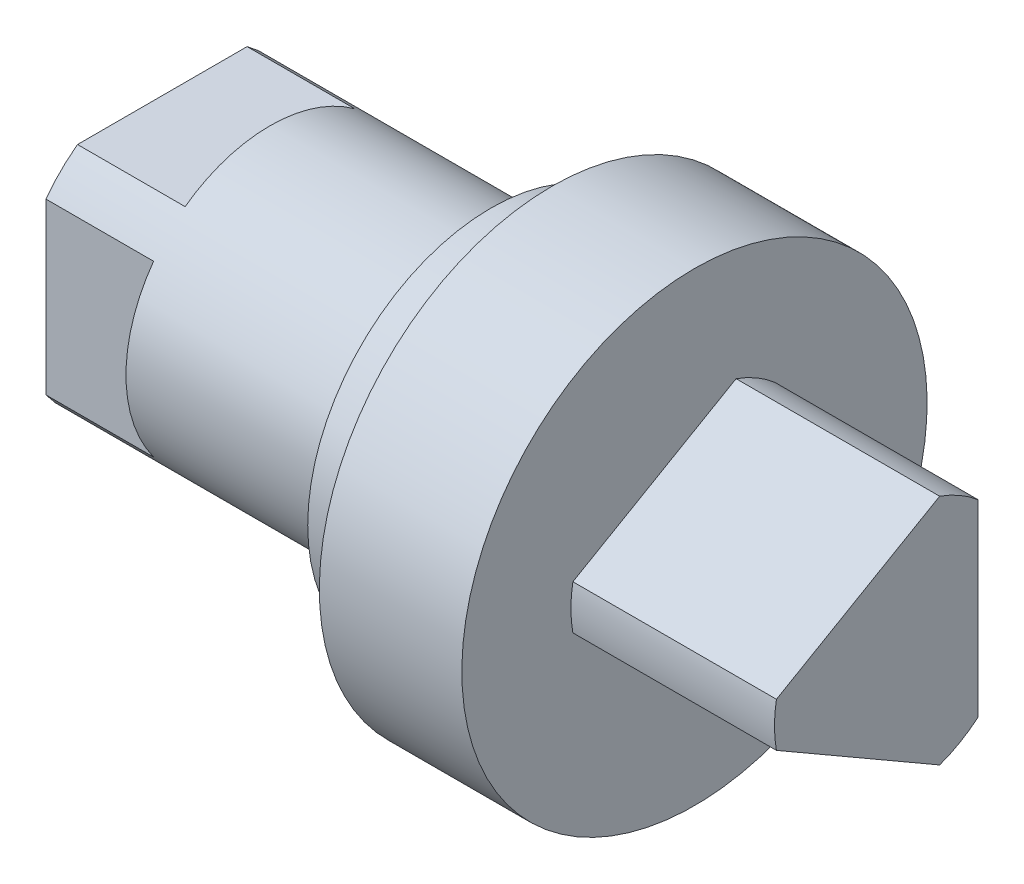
ISO-10303-21;
HEADER;
FILE_DESCRIPTION(('STEP AP214'),'2;1');
FILE_NAME('part.step','',(''),(''),'','','');
FILE_SCHEMA(('AUTOMOTIVE_DESIGN { 1 0 10303 214 1 1 1 1 }'));
ENDSEC;
DATA;
#1=APPLICATION_CONTEXT('core data for automotive mechanical design processes');
#2=APPLICATION_PROTOCOL_DEFINITION('international standard','automotive_design',2000,#1);
#3=PRODUCT_CONTEXT('',#1,'mechanical');
#4=PRODUCT('Part','Part','',(#3));
#5=PRODUCT_RELATED_PRODUCT_CATEGORY('part','',(#4));
#6=PRODUCT_DEFINITION_FORMATION('','',#4);
#7=PRODUCT_DEFINITION_CONTEXT('part definition',#1,'design');
#8=PRODUCT_DEFINITION('design','',#6,#7);
#9=PRODUCT_DEFINITION_SHAPE('','',#8);
#10=(LENGTH_UNIT() NAMED_UNIT(*) SI_UNIT(.MILLI.,.METRE.));
#11=(NAMED_UNIT(*) PLANE_ANGLE_UNIT() SI_UNIT($,.RADIAN.));
#12=(NAMED_UNIT(*) SI_UNIT($,.STERADIAN.) SOLID_ANGLE_UNIT());
#13=UNCERTAINTY_MEASURE_WITH_UNIT(LENGTH_MEASURE(1.E-05),#10,'distance_accuracy_value','');
#14=(GEOMETRIC_REPRESENTATION_CONTEXT(3) GLOBAL_UNCERTAINTY_ASSIGNED_CONTEXT((#13)) GLOBAL_UNIT_ASSIGNED_CONTEXT((#10,
#11,#12)) REPRESENTATION_CONTEXT('',''));
#15=CARTESIAN_POINT('',(0.,0.,0.));
#16=DIRECTION('',(0.,0.,1.));
#17=DIRECTION('',(1.,0.,0.));
#18=AXIS2_PLACEMENT_3D('',#15,#16,#17);
#19=CARTESIAN_POINT('',(-2.29999999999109,0.,0.));
#20=DIRECTION('',(-1.,0.,0.));
#21=DIRECTION('',(0.,0.,1.));
#22=AXIS2_PLACEMENT_3D('',#19,#20,#21);
#23=CONICAL_SURFACE('',#22,2.75000000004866,1.02974425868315);
#24=CARTESIAN_POINT('',(-0.647633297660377,0.,0.));
#25=VERTEX_POINT('',#24);
#26=VERTEX_LOOP('',#25);
#27=FACE_BOUND('',#26,.T.);
#28=CARTESIAN_POINT('',(-2.3,0.,0.));
#29=DIRECTION('',(-1.,0.,0.));
#30=DIRECTION('',(0.,0.,1.));
#31=AXIS2_PLACEMENT_3D('',#28,#29,#30);
#32=CIRCLE('',#31,2.74999999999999);
#33=CARTESIAN_POINT('',(-2.3,0.,2.74999999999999));
#34=VERTEX_POINT('',#33);
#35=EDGE_CURVE('E163',#34,#34,#32,.T.);
#36=ORIENTED_EDGE('',*,*,#35,.T.);
#37=EDGE_LOOP('',(#36));
#38=FACE_BOUND('',#37,.T.);
#39=ADVANCED_FACE('F16',(#27,#38),#23,.F.);
#40=CARTESIAN_POINT('',(-18.3,0.,0.));
#41=DIRECTION('',(-1.,0.,0.));
#42=DIRECTION('',(0.,0.,1.));
#43=AXIS2_PLACEMENT_3D('',#40,#41,#42);
#44=CYLINDRICAL_SURFACE('',#43,2.74999999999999);
#45=ORIENTED_EDGE('',*,*,#35,.F.);
#46=EDGE_LOOP('',(#45));
#47=FACE_BOUND('',#46,.T.);
#48=CARTESIAN_POINT('',(-18.0500000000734,0.,0.));
#49=DIRECTION('',(-1.,0.,0.));
#50=DIRECTION('',(0.,0.,1.));
#51=AXIS2_PLACEMENT_3D('',#48,#49,#50);
#52=CIRCLE('',#51,2.74999999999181);
#53=CARTESIAN_POINT('',(-18.0500000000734,0.,2.74999999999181));
#54=VERTEX_POINT('',#53);
#55=EDGE_CURVE('E109',#54,#54,#52,.T.);
#56=ORIENTED_EDGE('',*,*,#55,.T.);
#57=EDGE_LOOP('',(#56));
#58=FACE_BOUND('',#57,.T.);
#59=ADVANCED_FACE('F369',(#47,#58),#44,.F.);
#60=CARTESIAN_POINT('',(-18.299999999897,0.,0.));
#61=DIRECTION('',(-1.,0.,0.));
#62=DIRECTION('',(0.,0.,1.));
#63=AXIS2_PLACEMENT_3D('',#60,#61,#62);
#64=CONICAL_SURFACE('',#63,2.99999999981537,0.785398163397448);
#65=ORIENTED_EDGE('',*,*,#55,.F.);
#66=EDGE_LOOP('',(#65));
#67=FACE_BOUND('',#66,.T.);
#68=CARTESIAN_POINT('',(-18.3000000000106,0.,0.));
#69=DIRECTION('',(-1.,0.,0.));
#70=DIRECTION('',(0.,0.,1.));
#71=AXIS2_PLACEMENT_3D('',#68,#69,#70);
#72=CIRCLE('',#71,2.99999999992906);
#73=CARTESIAN_POINT('',(-18.3000000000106,0.,2.99999999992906));
#74=VERTEX_POINT('',#73);
#75=EDGE_CURVE('E154',#74,#74,#72,.F.);
#76=ORIENTED_EDGE('',*,*,#75,.F.);
#77=EDGE_LOOP('',(#76));
#78=FACE_BOUND('',#77,.T.);
#79=ADVANCED_FACE('F222',(#67,#78),#64,.F.);
#80=CARTESIAN_POINT('',(-18.3,0.,0.));
#81=DIRECTION('',(-1.,0.,0.));
#82=DIRECTION('',(0.,-1.,0.));
#83=AXIS2_PLACEMENT_3D('',#80,#81,#82);
#84=PLANE('',#83);
#85=ORIENTED_EDGE('',*,*,#75,.T.);
#86=EDGE_LOOP('',(#85));
#87=FACE_BOUND('',#86,.T.);
#88=CARTESIAN_POINT('',(-18.3,0.,0.));
#89=DIRECTION('',(1.,0.,0.));
#90=DIRECTION('',(0.,1.,0.));
#91=AXIS2_PLACEMENT_3D('',#88,#89,#90);
#92=CIRCLE('',#91,4.95);
#93=CARTESIAN_POINT('',(-18.3,-4.,2.91590466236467));
#94=VERTEX_POINT('',#93);
#95=CARTESIAN_POINT('',(-18.3,-2.91590466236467,4.));
#96=VERTEX_POINT('',#95);
#97=EDGE_CURVE('E202',#94,#96,#92,.F.);
#98=ORIENTED_EDGE('',*,*,#97,.T.);
#99=DIRECTION('',(0.,1.,0.));
#100=VECTOR('',#99,1.);
#101=CARTESIAN_POINT('',(-18.3,-2.91590466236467,4.));
#102=LINE('',#101,#100);
#103=CARTESIAN_POINT('',(-18.3,2.91590466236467,4.));
#104=VERTEX_POINT('',#103);
#105=EDGE_CURVE('E106',#96,#104,#102,.T.);
#106=ORIENTED_EDGE('',*,*,#105,.T.);
#107=CARTESIAN_POINT('',(-18.3,0.,0.));
#108=DIRECTION('',(1.,0.,0.));
#109=DIRECTION('',(0.,1.,0.));
#110=AXIS2_PLACEMENT_3D('',#107,#108,#109);
#111=CIRCLE('',#110,4.95);
#112=CARTESIAN_POINT('',(-18.3,4.,2.91590466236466));
#113=VERTEX_POINT('',#112);
#114=EDGE_CURVE('E19',#104,#113,#111,.F.);
#115=ORIENTED_EDGE('',*,*,#114,.T.);
#116=DIRECTION('',(0.,0.,-1.));
#117=VECTOR('',#116,1.);
#118=CARTESIAN_POINT('',(-18.3,4.,2.91590466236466));
#119=LINE('',#118,#117);
#120=CARTESIAN_POINT('',(-18.3,4.,-2.91590466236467));
#121=VERTEX_POINT('',#120);
#122=EDGE_CURVE('E103',#113,#121,#119,.T.);
#123=ORIENTED_EDGE('',*,*,#122,.T.);
#124=CARTESIAN_POINT('',(-18.3,0.,0.));
#125=DIRECTION('',(1.,0.,0.));
#126=DIRECTION('',(0.,1.,0.));
#127=AXIS2_PLACEMENT_3D('',#124,#125,#126);
#128=CIRCLE('',#127,4.95);
#129=CARTESIAN_POINT('',(-18.3,2.91590466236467,-4.));
#130=VERTEX_POINT('',#129);
#131=EDGE_CURVE('E108',#121,#130,#128,.F.);
#132=ORIENTED_EDGE('',*,*,#131,.T.);
#133=DIRECTION('',(0.,1.,0.));
#134=VECTOR('',#133,1.);
#135=CARTESIAN_POINT('',(-18.3,2.91590466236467,-4.));
#136=LINE('',#135,#134);
#137=CARTESIAN_POINT('',(-18.3,-2.91590466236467,-4.));
#138=VERTEX_POINT('',#137);
#139=EDGE_CURVE('E133',#130,#138,#136,.F.);
#140=ORIENTED_EDGE('',*,*,#139,.T.);
#141=CARTESIAN_POINT('',(-18.3,0.,0.));
#142=DIRECTION('',(1.,0.,0.));
#143=DIRECTION('',(0.,1.,0.));
#144=AXIS2_PLACEMENT_3D('',#141,#142,#143);
#145=CIRCLE('',#144,4.95);
#146=CARTESIAN_POINT('',(-18.3,-4.,-2.91590466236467));
#147=VERTEX_POINT('',#146);
#148=EDGE_CURVE('E204',#138,#147,#145,.F.);
#149=ORIENTED_EDGE('',*,*,#148,.T.);
#150=DIRECTION('',(0.,0.,1.));
#151=VECTOR('',#150,1.);
#152=CARTESIAN_POINT('',(-18.3,-4.,-2.91590466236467));
#153=LINE('',#152,#151);
#154=EDGE_CURVE('E137',#147,#94,#153,.T.);
#155=ORIENTED_EDGE('',*,*,#154,.T.);
#156=EDGE_LOOP('',(#98,#106,#115,#123,#132,#140,#149,#155));
#157=FACE_BOUND('',#156,.T.);
#158=ADVANCED_FACE('F102',(#87,#157),#84,.T.);
#159=CARTESIAN_POINT('',(-14.6,4.95,0.));
#160=DIRECTION('',(-1.,0.,0.));
#161=DIRECTION('',(0.,-1.,0.));
#162=AXIS2_PLACEMENT_3D('',#159,#160,#161);
#163=PLANE('',#162);
#164=DIRECTION('',(0.,1.,0.));
#165=VECTOR('',#164,1.);
#166=CARTESIAN_POINT('',(-14.6,2.91590466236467,-4.));
#167=LINE('',#166,#165);
#168=CARTESIAN_POINT('',(-14.6,-2.91590466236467,-4.));
#169=VERTEX_POINT('',#168);
#170=CARTESIAN_POINT('',(-14.6,2.91590466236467,-4.));
#171=VERTEX_POINT('',#170);
#172=EDGE_CURVE('E152',#169,#171,#167,.T.);
#173=ORIENTED_EDGE('',*,*,#172,.T.);
#174=CARTESIAN_POINT('',(-14.6,0.,0.));
#175=DIRECTION('',(1.,0.,0.));
#176=DIRECTION('',(0.,1.,0.));
#177=AXIS2_PLACEMENT_3D('',#174,#175,#176);
#178=CIRCLE('',#177,4.95);
#179=EDGE_CURVE('E148',#169,#171,#178,.T.);
#180=ORIENTED_EDGE('',*,*,#179,.F.);
#181=EDGE_LOOP('',(#173,#180));
#182=FACE_BOUND('',#181,.T.);
#183=ADVANCED_FACE('F212',(#182),#163,.T.);
#184=CARTESIAN_POINT('',(-18.3,2.91590466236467,-4.));
#185=DIRECTION('',(0.,0.,1.));
#186=DIRECTION('',(1.,0.,0.));
#187=AXIS2_PLACEMENT_3D('',#184,#185,#186);
#188=PLANE('',#187);
#189=ORIENTED_EDGE('',*,*,#139,.F.);
#190=DIRECTION('',(1.,0.,0.));
#191=VECTOR('',#190,1.);
#192=CARTESIAN_POINT('',(0.,2.91590466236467,-4.));
#193=LINE('',#192,#191);
#194=EDGE_CURVE('E143',#171,#130,#193,.F.);
#195=ORIENTED_EDGE('',*,*,#194,.F.);
#196=ORIENTED_EDGE('',*,*,#172,.F.);
#197=DIRECTION('',(1.,0.,0.));
#198=VECTOR('',#197,1.);
#199=CARTESIAN_POINT('',(0.,-2.91590466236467,-4.));
#200=LINE('',#199,#198);
#201=EDGE_CURVE('E145',#138,#169,#200,.T.);
#202=ORIENTED_EDGE('',*,*,#201,.F.);
#203=EDGE_LOOP('',(#189,#195,#196,#202));
#204=FACE_BOUND('',#203,.T.);
#205=ADVANCED_FACE('F209',(#204),#188,.F.);
#206=CARTESIAN_POINT('',(-14.6,4.95,0.));
#207=DIRECTION('',(-1.,0.,0.));
#208=DIRECTION('',(0.,-1.,0.));
#209=AXIS2_PLACEMENT_3D('',#206,#207,#208);
#210=PLANE('',#209);
#211=DIRECTION('',(0.,0.,1.));
#212=VECTOR('',#211,1.);
#213=CARTESIAN_POINT('',(-14.6,-4.,-2.91590466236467));
#214=LINE('',#213,#212);
#215=CARTESIAN_POINT('',(-14.6,-4.,2.91590466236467));
#216=VERTEX_POINT('',#215);
#217=CARTESIAN_POINT('',(-14.6,-4.,-2.91590466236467));
#218=VERTEX_POINT('',#217);
#219=EDGE_CURVE('E134',#216,#218,#214,.F.);
#220=ORIENTED_EDGE('',*,*,#219,.T.);
#221=CARTESIAN_POINT('',(-14.6,0.,0.));
#222=DIRECTION('',(1.,0.,0.));
#223=DIRECTION('',(0.,1.,0.));
#224=AXIS2_PLACEMENT_3D('',#221,#222,#223);
#225=CIRCLE('',#224,4.95);
#226=EDGE_CURVE('E127',#216,#218,#225,.T.);
#227=ORIENTED_EDGE('',*,*,#226,.F.);
#228=EDGE_LOOP('',(#220,#227));
#229=FACE_BOUND('',#228,.T.);
#230=ADVANCED_FACE('F220',(#229),#210,.T.);
#231=CARTESIAN_POINT('',(-14.6,4.95,0.));
#232=DIRECTION('',(-1.,0.,0.));
#233=DIRECTION('',(0.,-1.,0.));
#234=AXIS2_PLACEMENT_3D('',#231,#232,#233);
#235=PLANE('',#234);
#236=CARTESIAN_POINT('',(-14.6,0.,0.));
#237=DIRECTION('',(1.,0.,0.));
#238=DIRECTION('',(0.,1.,0.));
#239=AXIS2_PLACEMENT_3D('',#236,#237,#238);
#240=CIRCLE('',#239,4.95);
#241=CARTESIAN_POINT('',(-14.6,4.,-2.91590466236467));
#242=VERTEX_POINT('',#241);
#243=CARTESIAN_POINT('',(-14.6,4.,2.91590466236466));
#244=VERTEX_POINT('',#243);
#245=EDGE_CURVE('E122',#242,#244,#240,.T.);
#246=ORIENTED_EDGE('',*,*,#245,.F.);
#247=DIRECTION('',(0.,0.,-1.));
#248=VECTOR('',#247,1.);
#249=CARTESIAN_POINT('',(-14.6,4.,2.91590466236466));
#250=LINE('',#249,#248);
#251=EDGE_CURVE('E119',#242,#244,#250,.F.);
#252=ORIENTED_EDGE('',*,*,#251,.T.);
#253=EDGE_LOOP('',(#246,#252));
#254=FACE_BOUND('',#253,.T.);
#255=ADVANCED_FACE('F293',(#254),#235,.T.);
#256=CARTESIAN_POINT('',(-18.3,4.,2.91590466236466));
#257=DIRECTION('',(0.,-1.,0.));
#258=DIRECTION('',(0.,0.,-1.));
#259=AXIS2_PLACEMENT_3D('',#256,#257,#258);
#260=PLANE('',#259);
#261=ORIENTED_EDGE('',*,*,#122,.F.);
#262=DIRECTION('',(1.,0.,0.));
#263=VECTOR('',#262,1.);
#264=CARTESIAN_POINT('',(0.,4.,2.91590466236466));
#265=LINE('',#264,#263);
#266=EDGE_CURVE('E114',#244,#113,#265,.F.);
#267=ORIENTED_EDGE('',*,*,#266,.F.);
#268=ORIENTED_EDGE('',*,*,#251,.F.);
#269=DIRECTION('',(1.,0.,0.));
#270=VECTOR('',#269,1.);
#271=CARTESIAN_POINT('',(0.,4.,-2.91590466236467));
#272=LINE('',#271,#270);
#273=EDGE_CURVE('E117',#121,#242,#272,.T.);
#274=ORIENTED_EDGE('',*,*,#273,.F.);
#275=EDGE_LOOP('',(#261,#267,#268,#274));
#276=FACE_BOUND('',#275,.T.);
#277=ADVANCED_FACE('F112',(#276),#260,.F.);
#278=CARTESIAN_POINT('',(-14.6,4.95,0.));
#279=DIRECTION('',(-1.,0.,0.));
#280=DIRECTION('',(0.,-1.,0.));
#281=AXIS2_PLACEMENT_3D('',#278,#279,#280);
#282=PLANE('',#281);
#283=DIRECTION('',(0.,1.,0.));
#284=VECTOR('',#283,1.);
#285=CARTESIAN_POINT('',(-14.6,-2.91590466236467,4.));
#286=LINE('',#285,#284);
#287=CARTESIAN_POINT('',(-14.6,2.91590466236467,4.));
#288=VERTEX_POINT('',#287);
#289=CARTESIAN_POINT('',(-14.6,-2.91590466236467,4.));
#290=VERTEX_POINT('',#289);
#291=EDGE_CURVE('E118',#288,#290,#286,.F.);
#292=ORIENTED_EDGE('',*,*,#291,.T.);
#293=CARTESIAN_POINT('',(-14.6,0.,0.));
#294=DIRECTION('',(1.,0.,0.));
#295=DIRECTION('',(0.,1.,0.));
#296=AXIS2_PLACEMENT_3D('',#293,#294,#295);
#297=CIRCLE('',#296,4.95);
#298=EDGE_CURVE('E125',#288,#290,#297,.T.);
#299=ORIENTED_EDGE('',*,*,#298,.F.);
#300=EDGE_LOOP('',(#292,#299));
#301=FACE_BOUND('',#300,.T.);
#302=ADVANCED_FACE('F286',(#301),#282,.T.);
#303=CARTESIAN_POINT('',(-18.3,-2.91590466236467,4.));
#304=DIRECTION('',(0.,0.,-1.));
#305=DIRECTION('',(-1.,0.,0.));
#306=AXIS2_PLACEMENT_3D('',#303,#304,#305);
#307=PLANE('',#306);
#308=ORIENTED_EDGE('',*,*,#105,.F.);
#309=DIRECTION('',(1.,0.,0.));
#310=VECTOR('',#309,1.);
#311=CARTESIAN_POINT('',(0.,-2.91590466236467,4.));
#312=LINE('',#311,#310);
#313=EDGE_CURVE('E142',#290,#96,#312,.F.);
#314=ORIENTED_EDGE('',*,*,#313,.F.);
#315=ORIENTED_EDGE('',*,*,#291,.F.);
#316=DIRECTION('',(1.,0.,0.));
#317=VECTOR('',#316,1.);
#318=CARTESIAN_POINT('',(0.,2.91590466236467,4.));
#319=LINE('',#318,#317);
#320=EDGE_CURVE('E123',#104,#288,#319,.T.);
#321=ORIENTED_EDGE('',*,*,#320,.F.);
#322=EDGE_LOOP('',(#308,#314,#315,#321));
#323=FACE_BOUND('',#322,.T.);
#324=ADVANCED_FACE('F282',(#323),#307,.F.);
#325=CARTESIAN_POINT('',(-18.3,-4.,-2.91590466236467));
#326=DIRECTION('',(0.,1.,0.));
#327=DIRECTION('',(-1.,0.,0.));
#328=AXIS2_PLACEMENT_3D('',#325,#326,#327);
#329=PLANE('',#328);
#330=ORIENTED_EDGE('',*,*,#154,.F.);
#331=DIRECTION('',(1.,0.,0.));
#332=VECTOR('',#331,1.);
#333=CARTESIAN_POINT('',(0.,-4.,-2.91590466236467));
#334=LINE('',#333,#332);
#335=EDGE_CURVE('E149',#218,#147,#334,.F.);
#336=ORIENTED_EDGE('',*,*,#335,.F.);
#337=ORIENTED_EDGE('',*,*,#219,.F.);
#338=DIRECTION('',(1.,0.,0.));
#339=VECTOR('',#338,1.);
#340=CARTESIAN_POINT('',(0.,-4.,2.91590466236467));
#341=LINE('',#340,#339);
#342=EDGE_CURVE('E138',#94,#216,#341,.T.);
#343=ORIENTED_EDGE('',*,*,#342,.F.);
#344=EDGE_LOOP('',(#330,#336,#337,#343));
#345=FACE_BOUND('',#344,.T.);
#346=ADVANCED_FACE('F278',(#345),#329,.F.);
#347=CARTESIAN_POINT('',(0.,0.,0.));
#348=DIRECTION('',(1.,0.,0.));
#349=DIRECTION('',(0.,1.,0.));
#350=AXIS2_PLACEMENT_3D('',#347,#348,#349);
#351=CYLINDRICAL_SURFACE('',#350,4.95);
#352=CARTESIAN_POINT('',(-7.,0.,0.));
#353=DIRECTION('',(1.,0.,0.));
#354=DIRECTION('',(0.,1.,0.));
#355=AXIS2_PLACEMENT_3D('',#352,#353,#354);
#356=CIRCLE('',#355,4.95);
#357=CARTESIAN_POINT('',(-7.,4.95,0.));
#358=VERTEX_POINT('',#357);
#359=EDGE_CURVE('E141',#358,#358,#356,.T.);
#360=ORIENTED_EDGE('',*,*,#359,.F.);
#361=EDGE_LOOP('',(#360));
#362=FACE_BOUND('',#361,.T.);
#363=ORIENTED_EDGE('',*,*,#97,.F.);
#364=ORIENTED_EDGE('',*,*,#342,.T.);
#365=ORIENTED_EDGE('',*,*,#226,.T.);
#366=ORIENTED_EDGE('',*,*,#335,.T.);
#367=ORIENTED_EDGE('',*,*,#148,.F.);
#368=ORIENTED_EDGE('',*,*,#201,.T.);
#369=ORIENTED_EDGE('',*,*,#179,.T.);
#370=ORIENTED_EDGE('',*,*,#194,.T.);
#371=ORIENTED_EDGE('',*,*,#131,.F.);
#372=ORIENTED_EDGE('',*,*,#273,.T.);
#373=ORIENTED_EDGE('',*,*,#245,.T.);
#374=ORIENTED_EDGE('',*,*,#266,.T.);
#375=ORIENTED_EDGE('',*,*,#114,.F.);
#376=ORIENTED_EDGE('',*,*,#320,.T.);
#377=ORIENTED_EDGE('',*,*,#298,.T.);
#378=ORIENTED_EDGE('',*,*,#313,.T.);
#379=EDGE_LOOP('',(#363,#364,#365,#366,#367,#368,#369,#370,#371,#372,#373,#374,#375,#376,#377,#378));
#380=FACE_BOUND('',#379,.T.);
#381=ADVANCED_FACE('F121',(#362,#380),#351,.T.);
#382=CARTESIAN_POINT('',(-7.,6.3,0.));
#383=DIRECTION('',(-1.,0.,0.));
#384=DIRECTION('',(0.,-1.,0.));
#385=AXIS2_PLACEMENT_3D('',#382,#383,#384);
#386=PLANE('',#385);
#387=ORIENTED_EDGE('',*,*,#359,.T.);
#388=EDGE_LOOP('',(#387));
#389=FACE_BOUND('',#388,.T.);
#390=CARTESIAN_POINT('',(-7.,0.,0.));
#391=DIRECTION('',(1.,0.,0.));
#392=DIRECTION('',(0.,1.,0.));
#393=AXIS2_PLACEMENT_3D('',#390,#391,#392);
#394=CIRCLE('',#393,6.3);
#395=CARTESIAN_POINT('',(-7.,6.3,0.));
#396=VERTEX_POINT('',#395);
#397=EDGE_CURVE('E190',#396,#396,#394,.T.);
#398=ORIENTED_EDGE('',*,*,#397,.F.);
#399=EDGE_LOOP('',(#398));
#400=FACE_BOUND('',#399,.T.);
#401=ADVANCED_FACE('F271',(#389,#400),#386,.T.);
#402=CARTESIAN_POINT('',(0.,0.,0.));
#403=DIRECTION('',(1.,0.,0.));
#404=DIRECTION('',(0.,1.,0.));
#405=AXIS2_PLACEMENT_3D('',#402,#403,#404);
#406=CYLINDRICAL_SURFACE('',#405,6.3);
#407=CARTESIAN_POINT('',(-4.9,0.,0.));
#408=DIRECTION('',(1.,0.,0.));
#409=DIRECTION('',(0.,1.,0.));
#410=AXIS2_PLACEMENT_3D('',#407,#408,#409);
#411=CIRCLE('',#410,6.3);
#412=CARTESIAN_POINT('',(-4.9,6.3,0.));
#413=VERTEX_POINT('',#412);
#414=EDGE_CURVE('E171',#413,#413,#411,.T.);
#415=ORIENTED_EDGE('',*,*,#414,.F.);
#416=EDGE_LOOP('',(#415));
#417=FACE_BOUND('',#416,.T.);
#418=ORIENTED_EDGE('',*,*,#397,.T.);
#419=EDGE_LOOP('',(#418));
#420=FACE_BOUND('',#419,.T.);
#421=ADVANCED_FACE('F267',(#417,#420),#406,.T.);
#422=CARTESIAN_POINT('',(7.,0.,0.));
#423=DIRECTION('',(-1.,0.,0.));
#424=DIRECTION('',(0.,-1.,0.));
#425=AXIS2_PLACEMENT_3D('',#422,#423,#424);
#426=CYLINDRICAL_SURFACE('',#425,4.25);
#427=CARTESIAN_POINT('',(0.,0.,0.));
#428=DIRECTION('',(-1.,0.,0.));
#429=DIRECTION('',(0.,-1.,0.));
#430=AXIS2_PLACEMENT_3D('',#427,#428,#429);
#431=CIRCLE('',#430,4.25);
#432=CARTESIAN_POINT('',(0.,3.24037034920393,-2.75));
#433=VERTEX_POINT('',#432);
#434=CARTESIAN_POINT('',(0.,4.00175503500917,-1.43124304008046));
#435=VERTEX_POINT('',#434);
#436=EDGE_CURVE('E188',#433,#435,#431,.F.);
#437=ORIENTED_EDGE('',*,*,#436,.T.);
#438=DIRECTION('',(1.,0.,0.));
#439=VECTOR('',#438,1.);
#440=CARTESIAN_POINT('',(7.,4.00175503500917,-1.43124304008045));
#441=LINE('',#440,#439);
#442=CARTESIAN_POINT('',(7.,4.00175503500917,-1.43124304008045));
#443=VERTEX_POINT('',#442);
#444=EDGE_CURVE('E174',#435,#443,#441,.T.);
#445=ORIENTED_EDGE('',*,*,#444,.T.);
#446=CARTESIAN_POINT('',(7.,0.,0.));
#447=DIRECTION('',(-1.,0.,0.));
#448=DIRECTION('',(0.,-1.,0.));
#449=AXIS2_PLACEMENT_3D('',#446,#447,#448);
#450=CIRCLE('',#449,4.25);
#451=CARTESIAN_POINT('',(7.,3.24037034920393,-2.75));
#452=VERTEX_POINT('',#451);
#453=EDGE_CURVE('E181',#452,#443,#450,.F.);
#454=ORIENTED_EDGE('',*,*,#453,.F.);
#455=DIRECTION('',(1.,0.,0.));
#456=VECTOR('',#455,1.);
#457=CARTESIAN_POINT('',(7.,3.24037034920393,-2.75));
#458=LINE('',#457,#456);
#459=EDGE_CURVE('E317',#452,#433,#458,.F.);
#460=ORIENTED_EDGE('',*,*,#459,.T.);
#461=EDGE_LOOP('',(#437,#445,#454,#460));
#462=FACE_BOUND('',#461,.T.);
#463=ADVANCED_FACE('F264',(#462),#426,.T.);
#464=CARTESIAN_POINT('',(7.,0.,0.));
#465=DIRECTION('',(-1.,0.,0.));
#466=DIRECTION('',(0.,-1.,0.));
#467=AXIS2_PLACEMENT_3D('',#464,#465,#466);
#468=CYLINDRICAL_SURFACE('',#467,4.25);
#469=CARTESIAN_POINT('',(0.,0.,0.));
#470=DIRECTION('',(-1.,0.,0.));
#471=DIRECTION('',(0.,-1.,0.));
#472=AXIS2_PLACEMENT_3D('',#469,#470,#471);
#473=CIRCLE('',#472,4.25);
#474=CARTESIAN_POINT('',(0.,0.761384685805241,4.18124304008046));
#475=VERTEX_POINT('',#474);
#476=CARTESIAN_POINT('',(0.,-0.761384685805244,4.18124304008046));
#477=VERTEX_POINT('',#476);
#478=EDGE_CURVE('E34',#475,#477,#473,.F.);
#479=ORIENTED_EDGE('',*,*,#478,.T.);
#480=DIRECTION('',(1.,0.,0.));
#481=VECTOR('',#480,1.);
#482=CARTESIAN_POINT('',(7.,-0.761384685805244,4.18124304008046));
#483=LINE('',#482,#481);
#484=CARTESIAN_POINT('',(7.,-0.761384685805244,4.18124304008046));
#485=VERTEX_POINT('',#484);
#486=EDGE_CURVE('E322',#477,#485,#483,.T.);
#487=ORIENTED_EDGE('',*,*,#486,.T.);
#488=CARTESIAN_POINT('',(7.,0.,0.));
#489=DIRECTION('',(-1.,0.,0.));
#490=DIRECTION('',(0.,-1.,0.));
#491=AXIS2_PLACEMENT_3D('',#488,#489,#490);
#492=CIRCLE('',#491,4.25);
#493=CARTESIAN_POINT('',(7.,0.761384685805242,4.18124304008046));
#494=VERTEX_POINT('',#493);
#495=EDGE_CURVE('E184',#494,#485,#492,.F.);
#496=ORIENTED_EDGE('',*,*,#495,.F.);
#497=DIRECTION('',(1.,0.,0.));
#498=VECTOR('',#497,1.);
#499=CARTESIAN_POINT('',(7.,0.761384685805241,4.18124304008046));
#500=LINE('',#499,#498);
#501=EDGE_CURVE('E313',#494,#475,#500,.F.);
#502=ORIENTED_EDGE('',*,*,#501,.T.);
#503=EDGE_LOOP('',(#479,#487,#496,#502));
#504=FACE_BOUND('',#503,.T.);
#505=ADVANCED_FACE('F260',(#504),#468,.T.);
#506=CARTESIAN_POINT('',(7.,0.,0.));
#507=DIRECTION('',(1.,0.,0.));
#508=DIRECTION('',(0.,1.,0.));
#509=AXIS2_PLACEMENT_3D('',#506,#507,#508);
#510=PLANE('',#509);
#511=ORIENTED_EDGE('',*,*,#453,.T.);
#512=DIRECTION('',(0.,0.5,-0.866025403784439));
#513=VECTOR('',#512,1.);
#514=CARTESIAN_POINT('',(7.,4.00175503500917,-1.43124304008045));
#515=LINE('',#514,#513);
#516=EDGE_CURVE('E310',#443,#494,#515,.F.);
#517=ORIENTED_EDGE('',*,*,#516,.T.);
#518=ORIENTED_EDGE('',*,*,#495,.T.);
#519=DIRECTION('',(0.,0.499999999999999,0.866025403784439));
#520=VECTOR('',#519,1.);
#521=CARTESIAN_POINT('',(7.,-0.761384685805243,4.18124304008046));
#522=LINE('',#521,#520);
#523=CARTESIAN_POINT('',(7.,-4.00175503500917,-1.43124304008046));
#524=VERTEX_POINT('',#523);
#525=EDGE_CURVE('E319',#485,#524,#522,.F.);
#526=ORIENTED_EDGE('',*,*,#525,.T.);
#527=CARTESIAN_POINT('',(7.,0.,0.));
#528=DIRECTION('',(-1.,0.,0.));
#529=DIRECTION('',(0.,-1.,0.));
#530=AXIS2_PLACEMENT_3D('',#527,#528,#529);
#531=CIRCLE('',#530,4.25);
#532=CARTESIAN_POINT('',(7.,-3.24037034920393,-2.75));
#533=VERTEX_POINT('',#532);
#534=EDGE_CURVE('E178',#533,#524,#531,.T.);
#535=ORIENTED_EDGE('',*,*,#534,.F.);
#536=DIRECTION('',(0.,-1.,0.));
#537=VECTOR('',#536,1.);
#538=CARTESIAN_POINT('',(7.,-3.24037034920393,-2.75));
#539=LINE('',#538,#537);
#540=EDGE_CURVE('E314',#533,#452,#539,.F.);
#541=ORIENTED_EDGE('',*,*,#540,.T.);
#542=EDGE_LOOP('',(#511,#517,#518,#526,#535,#541));
#543=FACE_BOUND('',#542,.T.);
#544=ADVANCED_FACE('F256',(#543),#510,.T.);
#545=CARTESIAN_POINT('',(7.,0.,0.));
#546=DIRECTION('',(-1.,0.,0.));
#547=DIRECTION('',(0.,-1.,0.));
#548=AXIS2_PLACEMENT_3D('',#545,#546,#547);
#549=CYLINDRICAL_SURFACE('',#548,4.25);
#550=CARTESIAN_POINT('',(0.,0.,0.));
#551=DIRECTION('',(-1.,0.,0.));
#552=DIRECTION('',(0.,-1.,0.));
#553=AXIS2_PLACEMENT_3D('',#550,#551,#552);
#554=CIRCLE('',#553,4.25);
#555=CARTESIAN_POINT('',(0.,-4.00175503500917,-1.43124304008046));
#556=VERTEX_POINT('',#555);
#557=CARTESIAN_POINT('',(0.,-3.24037034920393,-2.75));
#558=VERTEX_POINT('',#557);
#559=EDGE_CURVE('E175',#556,#558,#554,.F.);
#560=ORIENTED_EDGE('',*,*,#559,.T.);
#561=DIRECTION('',(1.,0.,0.));
#562=VECTOR('',#561,1.);
#563=CARTESIAN_POINT('',(7.,-3.24037034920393,-2.75));
#564=LINE('',#563,#562);
#565=EDGE_CURVE('E318',#558,#533,#564,.T.);
#566=ORIENTED_EDGE('',*,*,#565,.T.);
#567=ORIENTED_EDGE('',*,*,#534,.T.);
#568=DIRECTION('',(1.,0.,0.));
#569=VECTOR('',#568,1.);
#570=CARTESIAN_POINT('',(7.,-4.00175503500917,-1.43124304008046));
#571=LINE('',#570,#569);
#572=EDGE_CURVE('E170',#524,#556,#571,.F.);
#573=ORIENTED_EDGE('',*,*,#572,.T.);
#574=EDGE_LOOP('',(#560,#566,#567,#573));
#575=FACE_BOUND('',#574,.T.);
#576=ADVANCED_FACE('F252',(#575),#549,.T.);
#577=CARTESIAN_POINT('',(-4.9,8.,0.));
#578=DIRECTION('',(-1.,0.,0.));
#579=DIRECTION('',(0.,-1.,0.));
#580=AXIS2_PLACEMENT_3D('',#577,#578,#579);
#581=PLANE('',#580);
#582=ORIENTED_EDGE('',*,*,#414,.T.);
#583=EDGE_LOOP('',(#582));
#584=FACE_BOUND('',#583,.T.);
#585=CARTESIAN_POINT('',(-4.9,0.,0.));
#586=DIRECTION('',(1.,0.,0.));
#587=DIRECTION('',(0.,1.,0.));
#588=AXIS2_PLACEMENT_3D('',#585,#586,#587);
#589=CIRCLE('',#588,8.);
#590=CARTESIAN_POINT('',(-4.9,8.,0.));
#591=VERTEX_POINT('',#590);
#592=EDGE_CURVE('E166',#591,#591,#589,.T.);
#593=ORIENTED_EDGE('',*,*,#592,.F.);
#594=EDGE_LOOP('',(#593));
#595=FACE_BOUND('',#594,.T.);
#596=ADVANCED_FACE('F248',(#584,#595),#581,.T.);
#597=CARTESIAN_POINT('',(7.,4.00175503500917,-1.43124304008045));
#598=DIRECTION('',(0.,-0.866025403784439,-0.5));
#599=DIRECTION('',(0.,0.5,-0.866025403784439));
#600=AXIS2_PLACEMENT_3D('',#597,#598,#599);
#601=PLANE('',#600);
#602=ORIENTED_EDGE('',*,*,#516,.F.);
#603=ORIENTED_EDGE('',*,*,#444,.F.);
#604=DIRECTION('',(0.,0.5,-0.866025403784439));
#605=VECTOR('',#604,1.);
#606=CARTESIAN_POINT('',(0.,0.761384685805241,4.18124304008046));
#607=LINE('',#606,#605);
#608=EDGE_CURVE('E169',#475,#435,#607,.T.);
#609=ORIENTED_EDGE('',*,*,#608,.F.);
#610=ORIENTED_EDGE('',*,*,#501,.F.);
#611=EDGE_LOOP('',(#602,#603,#609,#610));
#612=FACE_BOUND('',#611,.T.);
#613=ADVANCED_FACE('F244',(#612),#601,.F.);
#614=CARTESIAN_POINT('',(7.,-3.24037034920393,-2.75));
#615=DIRECTION('',(0.,0.,1.));
#616=DIRECTION('',(0.,-1.,0.));
#617=AXIS2_PLACEMENT_3D('',#614,#615,#616);
#618=PLANE('',#617);
#619=ORIENTED_EDGE('',*,*,#540,.F.);
#620=ORIENTED_EDGE('',*,*,#565,.F.);
#621=DIRECTION('',(0.,1.,0.));
#622=VECTOR('',#621,1.);
#623=CARTESIAN_POINT('',(0.,0.,-2.75));
#624=LINE('',#623,#622);
#625=EDGE_CURVE('E335',#433,#558,#624,.F.);
#626=ORIENTED_EDGE('',*,*,#625,.F.);
#627=ORIENTED_EDGE('',*,*,#459,.F.);
#628=EDGE_LOOP('',(#619,#620,#626,#627));
#629=FACE_BOUND('',#628,.T.);
#630=ADVANCED_FACE('F240',(#629),#618,.F.);
#631=CARTESIAN_POINT('',(7.,-0.761384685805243,4.18124304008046));
#632=DIRECTION('',(0.,0.866025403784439,-0.499999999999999));
#633=DIRECTION('',(0.,0.499999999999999,0.866025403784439));
#634=AXIS2_PLACEMENT_3D('',#631,#632,#633);
#635=PLANE('',#634);
#636=ORIENTED_EDGE('',*,*,#525,.F.);
#637=ORIENTED_EDGE('',*,*,#486,.F.);
#638=DIRECTION('',(0.,0.5,0.866025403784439));
#639=VECTOR('',#638,1.);
#640=CARTESIAN_POINT('',(0.,-4.00175503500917,-1.43124304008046));
#641=LINE('',#640,#639);
#642=EDGE_CURVE('E25',#556,#477,#641,.T.);
#643=ORIENTED_EDGE('',*,*,#642,.F.);
#644=ORIENTED_EDGE('',*,*,#572,.F.);
#645=EDGE_LOOP('',(#636,#637,#643,#644));
#646=FACE_BOUND('',#645,.T.);
#647=ADVANCED_FACE('F233',(#646),#635,.F.);
#648=CARTESIAN_POINT('',(0.,0.,0.));
#649=DIRECTION('',(1.,0.,0.));
#650=DIRECTION('',(0.,1.,0.));
#651=AXIS2_PLACEMENT_3D('',#648,#649,#650);
#652=CYLINDRICAL_SURFACE('',#651,8.);
#653=CARTESIAN_POINT('',(0.,0.,0.));
#654=DIRECTION('',(1.,0.,0.));
#655=DIRECTION('',(0.,1.,0.));
#656=AXIS2_PLACEMENT_3D('',#653,#654,#655);
#657=CIRCLE('',#656,8.);
#658=CARTESIAN_POINT('',(0.,8.,0.));
#659=VERTEX_POINT('',#658);
#660=EDGE_CURVE('E11',#659,#659,#657,.T.);
#661=ORIENTED_EDGE('',*,*,#660,.F.);
#662=EDGE_LOOP('',(#661));
#663=FACE_BOUND('',#662,.T.);
#664=ORIENTED_EDGE('',*,*,#592,.T.);
#665=EDGE_LOOP('',(#664));
#666=FACE_BOUND('',#665,.T.);
#667=ADVANCED_FACE('F227',(#663,#666),#652,.T.);
#668=CARTESIAN_POINT('',(0.,0.,0.));
#669=DIRECTION('',(1.,0.,0.));
#670=DIRECTION('',(0.,1.,0.));
#671=AXIS2_PLACEMENT_3D('',#668,#669,#670);
#672=PLANE('',#671);
#673=ORIENTED_EDGE('',*,*,#660,.T.);
#674=EDGE_LOOP('',(#673));
#675=FACE_BOUND('',#674,.T.);
#676=ORIENTED_EDGE('',*,*,#642,.T.);
#677=ORIENTED_EDGE('',*,*,#478,.F.);
#678=ORIENTED_EDGE('',*,*,#608,.T.);
#679=ORIENTED_EDGE('',*,*,#436,.F.);
#680=ORIENTED_EDGE('',*,*,#625,.T.);
#681=ORIENTED_EDGE('',*,*,#559,.F.);
#682=EDGE_LOOP('',(#676,#677,#678,#679,#680,#681));
#683=FACE_BOUND('',#682,.T.);
#684=ADVANCED_FACE('F225',(#675,#683),#672,.T.);
#685=CLOSED_SHELL('',(#39,#59,#79,#158,#183,#205,#230,#255,#277,#302,#324,#346,#381,#401,#421,
#463,#505,#544,#576,#596,#613,#630,#647,#667,#684));
#686=MANIFOLD_SOLID_BREP('B1',#685);
#687=ADVANCED_BREP_SHAPE_REPRESENTATION('',(#18,#686),#14);
#688=SHAPE_DEFINITION_REPRESENTATION(#9,#687);
ENDSEC;
END-ISO-10303-21;
